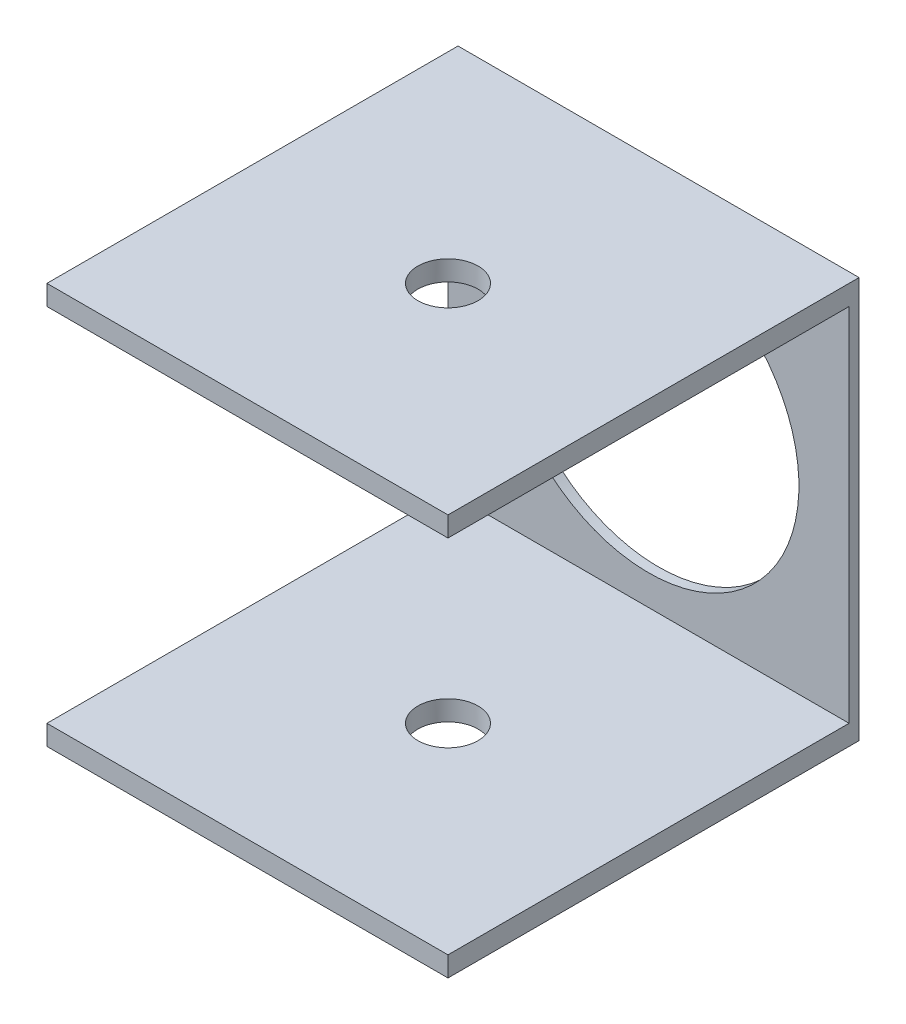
ISO-10303-21;
HEADER;
FILE_DESCRIPTION(('STEP AP214'),'2;1');
FILE_NAME('part.step','',(''),(''),'','','');
FILE_SCHEMA(('AUTOMOTIVE_DESIGN { 1 0 10303 214 1 1 1 1 }'));
ENDSEC;
DATA;
#1=APPLICATION_CONTEXT('core data for automotive mechanical design processes');
#2=APPLICATION_PROTOCOL_DEFINITION('international standard','automotive_design',2000,#1);
#3=PRODUCT_CONTEXT('',#1,'mechanical');
#4=PRODUCT('Part','Part','',(#3));
#5=PRODUCT_RELATED_PRODUCT_CATEGORY('part','',(#4));
#6=PRODUCT_DEFINITION_FORMATION('','',#4);
#7=PRODUCT_DEFINITION_CONTEXT('part definition',#1,'design');
#8=PRODUCT_DEFINITION('design','',#6,#7);
#9=PRODUCT_DEFINITION_SHAPE('','',#8);
#10=(LENGTH_UNIT() NAMED_UNIT(*) SI_UNIT(.MILLI.,.METRE.));
#11=(NAMED_UNIT(*) PLANE_ANGLE_UNIT() SI_UNIT($,.RADIAN.));
#12=(NAMED_UNIT(*) SI_UNIT($,.STERADIAN.) SOLID_ANGLE_UNIT());
#13=UNCERTAINTY_MEASURE_WITH_UNIT(LENGTH_MEASURE(1.E-05),#10,'distance_accuracy_value','');
#14=(GEOMETRIC_REPRESENTATION_CONTEXT(3) GLOBAL_UNCERTAINTY_ASSIGNED_CONTEXT((#13)) GLOBAL_UNIT_ASSIGNED_CONTEXT((#10,
#11,#12)) REPRESENTATION_CONTEXT('',''));
#15=CARTESIAN_POINT('',(0.,0.,0.));
#16=DIRECTION('',(0.,0.,1.));
#17=DIRECTION('',(1.,0.,0.));
#18=AXIS2_PLACEMENT_3D('',#15,#16,#17);
#19=CARTESIAN_POINT('',(0.,0.,1.));
#20=DIRECTION('',(0.,0.,1.));
#21=DIRECTION('',(1.,0.,0.));
#22=AXIS2_PLACEMENT_3D('',#19,#20,#21);
#23=PLANE('',#22);
#24=CARTESIAN_POINT('',(0.,0.,1.));
#25=DIRECTION('',(0.,0.,-1.));
#26=DIRECTION('',(-1.,0.,0.));
#27=AXIS2_PLACEMENT_3D('',#24,#25,#26);
#28=CIRCLE('',#27,15.);
#29=CARTESIAN_POINT('',(-15.,0.,1.));
#30=VERTEX_POINT('',#29);
#31=EDGE_CURVE('E191',#30,#30,#28,.T.);
#32=ORIENTED_EDGE('',*,*,#31,.T.);
#33=EDGE_LOOP('',(#32));
#34=FACE_BOUND('',#33,.T.);
#35=DIRECTION('',(0.,1.,0.));
#36=VECTOR('',#35,1.);
#37=CARTESIAN_POINT('',(-20.,20.,1.));
#38=LINE('',#37,#36);
#39=CARTESIAN_POINT('',(-20.,-18.,1.));
#40=VERTEX_POINT('',#39);
#41=CARTESIAN_POINT('',(-20.,18.,1.));
#42=VERTEX_POINT('',#41);
#43=EDGE_CURVE('E49',#40,#42,#38,.T.);
#44=ORIENTED_EDGE('',*,*,#43,.F.);
#45=DIRECTION('',(-1.,0.,0.));
#46=VECTOR('',#45,1.);
#47=CARTESIAN_POINT('',(-20.,-18.,1.));
#48=LINE('',#47,#46);
#49=CARTESIAN_POINT('',(20.,-18.,1.));
#50=VERTEX_POINT('',#49);
#51=EDGE_CURVE('E115',#50,#40,#48,.T.);
#52=ORIENTED_EDGE('',*,*,#51,.F.);
#53=DIRECTION('',(0.,-1.,0.));
#54=VECTOR('',#53,1.);
#55=CARTESIAN_POINT('',(20.,20.,1.));
#56=LINE('',#55,#54);
#57=CARTESIAN_POINT('',(20.,18.,1.));
#58=VERTEX_POINT('',#57);
#59=EDGE_CURVE('E138',#58,#50,#56,.T.);
#60=ORIENTED_EDGE('',*,*,#59,.F.);
#61=DIRECTION('',(-1.,0.,0.));
#62=VECTOR('',#61,1.);
#63=CARTESIAN_POINT('',(20.,18.,1.));
#64=LINE('',#63,#62);
#65=EDGE_CURVE('E133',#58,#42,#64,.T.);
#66=ORIENTED_EDGE('',*,*,#65,.T.);
#67=EDGE_LOOP('',(#44,#52,#60,#66));
#68=FACE_BOUND('',#67,.T.);
#69=ADVANCED_FACE('F32',(#34,#68),#23,.T.);
#70=CARTESIAN_POINT('',(20.,20.,1.));
#71=DIRECTION('',(1.,0.,0.));
#72=DIRECTION('',(0.,0.,-1.));
#73=AXIS2_PLACEMENT_3D('',#70,#71,#72);
#74=PLANE('',#73);
#75=DIRECTION('',(0.,-1.,0.));
#76=VECTOR('',#75,1.);
#77=CARTESIAN_POINT('',(20.,20.,0.));
#78=LINE('',#77,#76);
#79=CARTESIAN_POINT('',(20.,20.,0.));
#80=VERTEX_POINT('',#79);
#81=CARTESIAN_POINT('',(20.,-20.,0.));
#82=VERTEX_POINT('',#81);
#83=EDGE_CURVE('E153',#80,#82,#78,.T.);
#84=ORIENTED_EDGE('',*,*,#83,.F.);
#85=DIRECTION('',(0.,0.,-1.));
#86=VECTOR('',#85,1.);
#87=CARTESIAN_POINT('',(20.,20.,1.));
#88=LINE('',#87,#86);
#89=CARTESIAN_POINT('',(20.,20.,41.));
#90=VERTEX_POINT('',#89);
#91=EDGE_CURVE('E11',#90,#80,#88,.T.);
#92=ORIENTED_EDGE('',*,*,#91,.F.);
#93=DIRECTION('',(0.,1.,0.));
#94=VECTOR('',#93,1.);
#95=CARTESIAN_POINT('',(20.,18.,41.));
#96=LINE('',#95,#94);
#97=CARTESIAN_POINT('',(20.,18.,41.));
#98=VERTEX_POINT('',#97);
#99=EDGE_CURVE('E157',#98,#90,#96,.T.);
#100=ORIENTED_EDGE('',*,*,#99,.F.);
#101=DIRECTION('',(0.,0.,-1.));
#102=VECTOR('',#101,1.);
#103=CARTESIAN_POINT('',(20.,18.,1.));
#104=LINE('',#103,#102);
#105=EDGE_CURVE('E124',#98,#58,#104,.T.);
#106=ORIENTED_EDGE('',*,*,#105,.T.);
#107=ORIENTED_EDGE('',*,*,#59,.T.);
#108=DIRECTION('',(0.,0.,-1.));
#109=VECTOR('',#108,1.);
#110=CARTESIAN_POINT('',(20.,-18.,41.));
#111=LINE('',#110,#109);
#112=CARTESIAN_POINT('',(20.,-18.,41.));
#113=VERTEX_POINT('',#112);
#114=EDGE_CURVE('E110',#113,#50,#111,.T.);
#115=ORIENTED_EDGE('',*,*,#114,.F.);
#116=DIRECTION('',(0.,-1.,0.));
#117=VECTOR('',#116,1.);
#118=CARTESIAN_POINT('',(20.,-18.,41.));
#119=LINE('',#118,#117);
#120=CARTESIAN_POINT('',(20.,-20.,41.));
#121=VERTEX_POINT('',#120);
#122=EDGE_CURVE('E107',#113,#121,#119,.T.);
#123=ORIENTED_EDGE('',*,*,#122,.T.);
#124=DIRECTION('',(0.,0.,-1.));
#125=VECTOR('',#124,1.);
#126=CARTESIAN_POINT('',(20.,-20.,1.));
#127=LINE('',#126,#125);
#128=EDGE_CURVE('E148',#121,#82,#127,.T.);
#129=ORIENTED_EDGE('',*,*,#128,.T.);
#130=EDGE_LOOP('',(#84,#92,#100,#106,#107,#115,#123,#129));
#131=FACE_BOUND('',#130,.T.);
#132=ADVANCED_FACE('F169',(#131),#74,.T.);
#133=CARTESIAN_POINT('',(20.,20.,1.));
#134=DIRECTION('',(0.,1.,0.));
#135=DIRECTION('',(0.,0.,1.));
#136=AXIS2_PLACEMENT_3D('',#133,#134,#135);
#137=PLANE('',#136);
#138=CARTESIAN_POINT('',(0.,20.,21.));
#139=DIRECTION('',(0.,1.,0.));
#140=DIRECTION('',(0.,0.,1.));
#141=AXIS2_PLACEMENT_3D('',#138,#139,#140);
#142=CIRCLE('',#141,3.);
#143=CARTESIAN_POINT('',(0.,20.,24.));
#144=VERTEX_POINT('',#143);
#145=EDGE_CURVE('E203',#144,#144,#142,.T.);
#146=ORIENTED_EDGE('',*,*,#145,.F.);
#147=EDGE_LOOP('',(#146));
#148=FACE_BOUND('',#147,.T.);
#149=DIRECTION('',(1.,0.,0.));
#150=VECTOR('',#149,1.);
#151=CARTESIAN_POINT('',(20.,20.,0.));
#152=LINE('',#151,#150);
#153=CARTESIAN_POINT('',(-20.,20.,0.));
#154=VERTEX_POINT('',#153);
#155=EDGE_CURVE('E163',#154,#80,#152,.T.);
#156=ORIENTED_EDGE('',*,*,#155,.F.);
#157=DIRECTION('',(0.,0.,-1.));
#158=VECTOR('',#157,1.);
#159=CARTESIAN_POINT('',(-20.,20.,1.));
#160=LINE('',#159,#158);
#161=CARTESIAN_POINT('',(-20.,20.,41.));
#162=VERTEX_POINT('',#161);
#163=EDGE_CURVE('E41',#162,#154,#160,.T.);
#164=ORIENTED_EDGE('',*,*,#163,.F.);
#165=DIRECTION('',(1.,0.,0.));
#166=VECTOR('',#165,1.);
#167=CARTESIAN_POINT('',(20.,20.,41.));
#168=LINE('',#167,#166);
#169=EDGE_CURVE('E122',#162,#90,#168,.T.);
#170=ORIENTED_EDGE('',*,*,#169,.T.);
#171=ORIENTED_EDGE('',*,*,#91,.T.);
#172=EDGE_LOOP('',(#156,#164,#170,#171));
#173=FACE_BOUND('',#172,.T.);
#174=ADVANCED_FACE('F173',(#148,#173),#137,.T.);
#175=CARTESIAN_POINT('',(-20.,20.,1.));
#176=DIRECTION('',(-1.,0.,0.));
#177=DIRECTION('',(0.,0.,1.));
#178=AXIS2_PLACEMENT_3D('',#175,#176,#177);
#179=PLANE('',#178);
#180=DIRECTION('',(0.,1.,0.));
#181=VECTOR('',#180,1.);
#182=CARTESIAN_POINT('',(-20.,20.,0.));
#183=LINE('',#182,#181);
#184=CARTESIAN_POINT('',(-20.,-20.,0.));
#185=VERTEX_POINT('',#184);
#186=EDGE_CURVE('E160',#185,#154,#183,.T.);
#187=ORIENTED_EDGE('',*,*,#186,.F.);
#188=DIRECTION('',(0.,0.,-1.));
#189=VECTOR('',#188,1.);
#190=CARTESIAN_POINT('',(-20.,-20.,1.));
#191=LINE('',#190,#189);
#192=CARTESIAN_POINT('',(-20.,-20.,41.));
#193=VERTEX_POINT('',#192);
#194=EDGE_CURVE('E120',#193,#185,#191,.T.);
#195=ORIENTED_EDGE('',*,*,#194,.F.);
#196=DIRECTION('',(0.,-1.,0.));
#197=VECTOR('',#196,1.);
#198=CARTESIAN_POINT('',(-20.,-18.,41.));
#199=LINE('',#198,#197);
#200=CARTESIAN_POINT('',(-20.,-18.,41.));
#201=VERTEX_POINT('',#200);
#202=EDGE_CURVE('E105',#201,#193,#199,.T.);
#203=ORIENTED_EDGE('',*,*,#202,.F.);
#204=DIRECTION('',(0.,0.,1.));
#205=VECTOR('',#204,1.);
#206=CARTESIAN_POINT('',(-20.,-18.,41.));
#207=LINE('',#206,#205);
#208=EDGE_CURVE('E111',#40,#201,#207,.T.);
#209=ORIENTED_EDGE('',*,*,#208,.F.);
#210=ORIENTED_EDGE('',*,*,#43,.T.);
#211=DIRECTION('',(0.,0.,1.));
#212=VECTOR('',#211,1.);
#213=CARTESIAN_POINT('',(-20.,18.,1.));
#214=LINE('',#213,#212);
#215=CARTESIAN_POINT('',(-20.,18.,41.));
#216=VERTEX_POINT('',#215);
#217=EDGE_CURVE('E137',#42,#216,#214,.T.);
#218=ORIENTED_EDGE('',*,*,#217,.T.);
#219=DIRECTION('',(0.,1.,0.));
#220=VECTOR('',#219,1.);
#221=CARTESIAN_POINT('',(-20.,18.,41.));
#222=LINE('',#221,#220);
#223=EDGE_CURVE('E176',#216,#162,#222,.T.);
#224=ORIENTED_EDGE('',*,*,#223,.T.);
#225=ORIENTED_EDGE('',*,*,#163,.T.);
#226=EDGE_LOOP('',(#187,#195,#203,#209,#210,#218,#224,#225));
#227=FACE_BOUND('',#226,.T.);
#228=ADVANCED_FACE('F119',(#227),#179,.T.);
#229=CARTESIAN_POINT('',(20.,-20.,1.));
#230=DIRECTION('',(0.,-1.,0.));
#231=DIRECTION('',(0.,0.,-1.));
#232=AXIS2_PLACEMENT_3D('',#229,#230,#231);
#233=PLANE('',#232);
#234=CARTESIAN_POINT('',(0.,-20.,21.));
#235=DIRECTION('',(0.,1.,0.));
#236=DIRECTION('',(0.,0.,1.));
#237=AXIS2_PLACEMENT_3D('',#234,#235,#236);
#238=CIRCLE('',#237,3.);
#239=CARTESIAN_POINT('',(0.,-20.,24.));
#240=VERTEX_POINT('',#239);
#241=EDGE_CURVE('E206',#240,#240,#238,.T.);
#242=ORIENTED_EDGE('',*,*,#241,.T.);
#243=EDGE_LOOP('',(#242));
#244=FACE_BOUND('',#243,.T.);
#245=DIRECTION('',(-1.,0.,0.));
#246=VECTOR('',#245,1.);
#247=CARTESIAN_POINT('',(20.,-20.,0.));
#248=LINE('',#247,#246);
#249=EDGE_CURVE('E156',#82,#185,#248,.T.);
#250=ORIENTED_EDGE('',*,*,#249,.F.);
#251=ORIENTED_EDGE('',*,*,#128,.F.);
#252=DIRECTION('',(1.,0.,0.));
#253=VECTOR('',#252,1.);
#254=CARTESIAN_POINT('',(-20.,-20.,41.));
#255=LINE('',#254,#253);
#256=EDGE_CURVE('E116',#193,#121,#255,.T.);
#257=ORIENTED_EDGE('',*,*,#256,.F.);
#258=ORIENTED_EDGE('',*,*,#194,.T.);
#259=EDGE_LOOP('',(#250,#251,#257,#258));
#260=FACE_BOUND('',#259,.T.);
#261=ADVANCED_FACE('F171',(#244,#260),#233,.T.);
#262=CARTESIAN_POINT('',(0.,0.,0.));
#263=DIRECTION('',(0.,0.,1.));
#264=DIRECTION('',(1.,0.,0.));
#265=AXIS2_PLACEMENT_3D('',#262,#263,#264);
#266=PLANE('',#265);
#267=CARTESIAN_POINT('',(0.,0.,0.));
#268=DIRECTION('',(0.,0.,-1.));
#269=DIRECTION('',(-1.,0.,0.));
#270=AXIS2_PLACEMENT_3D('',#267,#268,#269);
#271=CIRCLE('',#270,15.);
#272=CARTESIAN_POINT('',(-15.,0.,0.));
#273=VERTEX_POINT('',#272);
#274=EDGE_CURVE('E193',#273,#273,#271,.T.);
#275=ORIENTED_EDGE('',*,*,#274,.F.);
#276=EDGE_LOOP('',(#275));
#277=FACE_BOUND('',#276,.T.);
#278=ORIENTED_EDGE('',*,*,#83,.T.);
#279=ORIENTED_EDGE('',*,*,#249,.T.);
#280=ORIENTED_EDGE('',*,*,#186,.T.);
#281=ORIENTED_EDGE('',*,*,#155,.T.);
#282=EDGE_LOOP('',(#278,#279,#280,#281));
#283=FACE_BOUND('',#282,.T.);
#284=ADVANCED_FACE('F34',(#277,#283),#266,.F.);
#285=CARTESIAN_POINT('',(20.,18.,41.));
#286=DIRECTION('',(0.,0.,1.));
#287=DIRECTION('',(1.,0.,0.));
#288=AXIS2_PLACEMENT_3D('',#285,#286,#287);
#289=PLANE('',#288);
#290=ORIENTED_EDGE('',*,*,#169,.F.);
#291=ORIENTED_EDGE('',*,*,#223,.F.);
#292=DIRECTION('',(1.,0.,0.));
#293=VECTOR('',#292,1.);
#294=CARTESIAN_POINT('',(20.,18.,41.));
#295=LINE('',#294,#293);
#296=EDGE_CURVE('E131',#216,#98,#295,.T.);
#297=ORIENTED_EDGE('',*,*,#296,.T.);
#298=ORIENTED_EDGE('',*,*,#99,.T.);
#299=EDGE_LOOP('',(#290,#291,#297,#298));
#300=FACE_BOUND('',#299,.T.);
#301=ADVANCED_FACE('F181',(#300),#289,.T.);
#302=CARTESIAN_POINT('',(20.,18.,41.));
#303=DIRECTION('',(0.,-1.,0.));
#304=DIRECTION('',(0.,0.,-1.));
#305=AXIS2_PLACEMENT_3D('',#302,#303,#304);
#306=PLANE('',#305);
#307=CARTESIAN_POINT('',(0.,18.,21.));
#308=DIRECTION('',(0.,-1.,0.));
#309=DIRECTION('',(0.,0.,-1.));
#310=AXIS2_PLACEMENT_3D('',#307,#308,#309);
#311=CIRCLE('',#310,3.);
#312=CARTESIAN_POINT('',(0.,18.,18.));
#313=VERTEX_POINT('',#312);
#314=EDGE_CURVE('E198',#313,#313,#311,.T.);
#315=ORIENTED_EDGE('',*,*,#314,.F.);
#316=EDGE_LOOP('',(#315));
#317=FACE_BOUND('',#316,.T.);
#318=ORIENTED_EDGE('',*,*,#105,.F.);
#319=ORIENTED_EDGE('',*,*,#296,.F.);
#320=ORIENTED_EDGE('',*,*,#217,.F.);
#321=ORIENTED_EDGE('',*,*,#65,.F.);
#322=EDGE_LOOP('',(#318,#319,#320,#321));
#323=FACE_BOUND('',#322,.T.);
#324=ADVANCED_FACE('F187',(#317,#323),#306,.T.);
#325=CARTESIAN_POINT('',(-20.,-18.,41.));
#326=DIRECTION('',(0.,0.,-1.));
#327=DIRECTION('',(-1.,0.,0.));
#328=AXIS2_PLACEMENT_3D('',#325,#326,#327);
#329=PLANE('',#328);
#330=ORIENTED_EDGE('',*,*,#256,.T.);
#331=ORIENTED_EDGE('',*,*,#122,.F.);
#332=DIRECTION('',(1.,0.,0.));
#333=VECTOR('',#332,1.);
#334=CARTESIAN_POINT('',(-20.,-18.,41.));
#335=LINE('',#334,#333);
#336=EDGE_CURVE('E100',#201,#113,#335,.T.);
#337=ORIENTED_EDGE('',*,*,#336,.F.);
#338=ORIENTED_EDGE('',*,*,#202,.T.);
#339=EDGE_LOOP('',(#330,#331,#337,#338));
#340=FACE_BOUND('',#339,.T.);
#341=ADVANCED_FACE('F103',(#340),#329,.F.);
#342=CARTESIAN_POINT('',(-20.,-18.,1.));
#343=DIRECTION('',(0.,-1.,0.));
#344=DIRECTION('',(0.,0.,-1.));
#345=AXIS2_PLACEMENT_3D('',#342,#343,#344);
#346=PLANE('',#345);
#347=CARTESIAN_POINT('',(0.,-18.,21.));
#348=DIRECTION('',(0.,-1.,0.));
#349=DIRECTION('',(0.,0.,-1.));
#350=AXIS2_PLACEMENT_3D('',#347,#348,#349);
#351=CIRCLE('',#350,3.);
#352=CARTESIAN_POINT('',(0.,-18.,18.));
#353=VERTEX_POINT('',#352);
#354=EDGE_CURVE('E36',#353,#353,#351,.T.);
#355=ORIENTED_EDGE('',*,*,#354,.T.);
#356=EDGE_LOOP('',(#355));
#357=FACE_BOUND('',#356,.T.);
#358=ORIENTED_EDGE('',*,*,#208,.T.);
#359=ORIENTED_EDGE('',*,*,#336,.T.);
#360=ORIENTED_EDGE('',*,*,#114,.T.);
#361=ORIENTED_EDGE('',*,*,#51,.T.);
#362=EDGE_LOOP('',(#358,#359,#360,#361));
#363=FACE_BOUND('',#362,.T.);
#364=ADVANCED_FACE('F113',(#357,#363),#346,.F.);
#365=CARTESIAN_POINT('',(0.,0.,1.));
#366=DIRECTION('',(0.,0.,-1.));
#367=DIRECTION('',(-1.,0.,0.));
#368=AXIS2_PLACEMENT_3D('',#365,#366,#367);
#369=CYLINDRICAL_SURFACE('',#368,15.);
#370=ORIENTED_EDGE('',*,*,#31,.F.);
#371=EDGE_LOOP('',(#370));
#372=FACE_BOUND('',#371,.T.);
#373=ORIENTED_EDGE('',*,*,#274,.T.);
#374=EDGE_LOOP('',(#373));
#375=FACE_BOUND('',#374,.T.);
#376=ADVANCED_FACE('F217',(#372,#375),#369,.F.);
#377=CARTESIAN_POINT('',(0.,-20.,21.));
#378=DIRECTION('',(0.,1.,0.));
#379=DIRECTION('',(0.,0.,1.));
#380=AXIS2_PLACEMENT_3D('',#377,#378,#379);
#381=CYLINDRICAL_SURFACE('',#380,3.);
#382=ORIENTED_EDGE('',*,*,#241,.F.);
#383=EDGE_LOOP('',(#382));
#384=FACE_BOUND('',#383,.T.);
#385=ORIENTED_EDGE('',*,*,#354,.F.);
#386=EDGE_LOOP('',(#385));
#387=FACE_BOUND('',#386,.T.);
#388=ADVANCED_FACE('F214',(#384,#387),#381,.F.);
#389=ORIENTED_EDGE('',*,*,#314,.T.);
#390=EDGE_LOOP('',(#389));
#391=FACE_BOUND('',#390,.T.);
#392=ORIENTED_EDGE('',*,*,#145,.T.);
#393=EDGE_LOOP('',(#392));
#394=FACE_BOUND('',#393,.T.);
#395=ADVANCED_FACE('F216',(#391,#394),#381,.F.);
#396=CLOSED_SHELL('',(#69,#132,#174,#228,#261,#284,#301,#324,#341,#364,#376,#388,#395));
#397=MANIFOLD_SOLID_BREP('B2',#396);
#398=ADVANCED_BREP_SHAPE_REPRESENTATION('',(#18,#397),#14);
#399=SHAPE_DEFINITION_REPRESENTATION(#9,#398);
ENDSEC;
END-ISO-10303-21;
